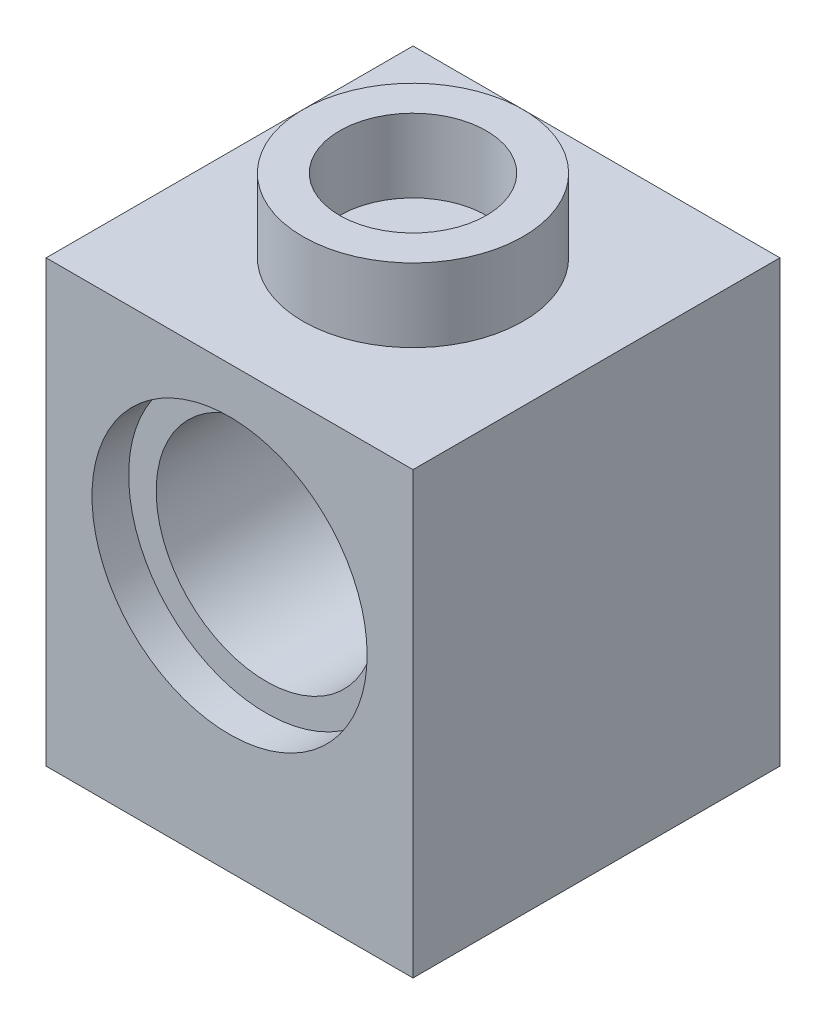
ISO-10303-21;
HEADER;
FILE_DESCRIPTION(('STEP AP214'),'2;1');
FILE_NAME('part.step','',(''),(''),'','','');
FILE_SCHEMA(('AUTOMOTIVE_DESIGN { 1 0 10303 214 1 1 1 1 }'));
ENDSEC;
DATA;
#1=APPLICATION_CONTEXT('core data for automotive mechanical design processes');
#2=APPLICATION_PROTOCOL_DEFINITION('international standard','automotive_design',2000,#1);
#3=PRODUCT_CONTEXT('',#1,'mechanical');
#4=PRODUCT('Part','Part','',(#3));
#5=PRODUCT_RELATED_PRODUCT_CATEGORY('part','',(#4));
#6=PRODUCT_DEFINITION_FORMATION('','',#4);
#7=PRODUCT_DEFINITION_CONTEXT('part definition',#1,'design');
#8=PRODUCT_DEFINITION('design','',#6,#7);
#9=PRODUCT_DEFINITION_SHAPE('','',#8);
#10=(LENGTH_UNIT() NAMED_UNIT(*) SI_UNIT(.MILLI.,.METRE.));
#11=(NAMED_UNIT(*) PLANE_ANGLE_UNIT() SI_UNIT($,.RADIAN.));
#12=(NAMED_UNIT(*) SI_UNIT($,.STERADIAN.) SOLID_ANGLE_UNIT());
#13=UNCERTAINTY_MEASURE_WITH_UNIT(LENGTH_MEASURE(1.E-05),#10,'distance_accuracy_value','');
#14=(GEOMETRIC_REPRESENTATION_CONTEXT(3) GLOBAL_UNCERTAINTY_ASSIGNED_CONTEXT((#13)) GLOBAL_UNIT_ASSIGNED_CONTEXT((#10,
#11,#12)) REPRESENTATION_CONTEXT('',''));
#15=CARTESIAN_POINT('',(0.,0.,0.));
#16=DIRECTION('',(0.,0.,1.));
#17=DIRECTION('',(1.,0.,0.));
#18=AXIS2_PLACEMENT_3D('',#15,#16,#17);
#19=CARTESIAN_POINT('',(4.,5.6,-11.8));
#20=DIRECTION('',(0.,0.,1.));
#21=DIRECTION('',(1.,0.,0.));
#22=AXIS2_PLACEMENT_3D('',#19,#20,#21);
#23=CYLINDRICAL_SURFACE('',#22,2.4);
#24=CARTESIAN_POINT('',(4.,5.6,-0.8));
#25=DIRECTION('',(0.,0.,1.));
#26=DIRECTION('',(1.,0.,0.));
#27=AXIS2_PLACEMENT_3D('',#24,#25,#26);
#28=CIRCLE('',#27,2.4);
#29=CARTESIAN_POINT('',(6.4,5.6,-0.8));
#30=VERTEX_POINT('',#29);
#31=EDGE_CURVE('E174',#30,#30,#28,.T.);
#32=ORIENTED_EDGE('',*,*,#31,.T.);
#33=EDGE_LOOP('',(#32));
#34=FACE_BOUND('',#33,.T.);
#35=CARTESIAN_POINT('',(4.,5.6,-7.2));
#36=DIRECTION('',(0.,0.,-1.));
#37=DIRECTION('',(-1.,0.,0.));
#38=AXIS2_PLACEMENT_3D('',#35,#36,#37);
#39=CIRCLE('',#38,2.4);
#40=CARTESIAN_POINT('',(1.6,5.6,-7.2));
#41=VERTEX_POINT('',#40);
#42=EDGE_CURVE('E164',#41,#41,#39,.F.);
#43=ORIENTED_EDGE('',*,*,#42,.F.);
#44=EDGE_LOOP('',(#43));
#45=FACE_BOUND('',#44,.T.);
#46=ADVANCED_FACE('F38',(#34,#45),#23,.F.);
#47=CARTESIAN_POINT('',(0.,9.6,0.));
#48=DIRECTION('',(1.,0.,0.));
#49=DIRECTION('',(0.,0.,-1.));
#50=AXIS2_PLACEMENT_3D('',#47,#48,#49);
#51=PLANE('',#50);
#52=DIRECTION('',(0.,0.,1.));
#53=VECTOR('',#52,1.);
#54=CARTESIAN_POINT('',(0.,0.,0.));
#55=LINE('',#54,#53);
#56=CARTESIAN_POINT('',(0.,0.,-8.));
#57=VERTEX_POINT('',#56);
#58=CARTESIAN_POINT('',(0.,0.,0.));
#59=VERTEX_POINT('',#58);
#60=EDGE_CURVE('E170',#57,#59,#55,.T.);
#61=ORIENTED_EDGE('',*,*,#60,.T.);
#62=DIRECTION('',(0.,-1.,0.));
#63=VECTOR('',#62,1.);
#64=CARTESIAN_POINT('',(0.,9.6,0.));
#65=LINE('',#64,#63);
#66=CARTESIAN_POINT('',(0.,9.6,0.));
#67=VERTEX_POINT('',#66);
#68=EDGE_CURVE('E46',#67,#59,#65,.T.);
#69=ORIENTED_EDGE('',*,*,#68,.F.);
#70=DIRECTION('',(0.,0.,1.));
#71=VECTOR('',#70,1.);
#72=CARTESIAN_POINT('',(0.,9.6,0.));
#73=LINE('',#72,#71);
#74=CARTESIAN_POINT('',(0.,9.6,-8.));
#75=VERTEX_POINT('',#74);
#76=EDGE_CURVE('E175',#75,#67,#73,.T.);
#77=ORIENTED_EDGE('',*,*,#76,.F.);
#78=DIRECTION('',(0.,-1.,0.));
#79=VECTOR('',#78,1.);
#80=CARTESIAN_POINT('',(0.,9.6,-8.));
#81=LINE('',#80,#79);
#82=EDGE_CURVE('E181',#75,#57,#81,.T.);
#83=ORIENTED_EDGE('',*,*,#82,.T.);
#84=EDGE_LOOP('',(#61,#69,#77,#83));
#85=FACE_BOUND('',#84,.T.);
#86=ADVANCED_FACE('F40',(#85),#51,.F.);
#87=CARTESIAN_POINT('',(0.,9.6,0.));
#88=DIRECTION('',(0.,0.,-1.));
#89=DIRECTION('',(-1.,0.,0.));
#90=AXIS2_PLACEMENT_3D('',#87,#88,#89);
#91=PLANE('',#90);
#92=CARTESIAN_POINT('',(4.,5.6,0.));
#93=DIRECTION('',(0.,0.,1.));
#94=DIRECTION('',(1.,0.,0.));
#95=AXIS2_PLACEMENT_3D('',#92,#93,#94);
#96=CIRCLE('',#95,3.);
#97=CARTESIAN_POINT('',(7.,5.6,0.));
#98=VERTEX_POINT('',#97);
#99=EDGE_CURVE('E171',#98,#98,#96,.T.);
#100=ORIENTED_EDGE('',*,*,#99,.F.);
#101=EDGE_LOOP('',(#100));
#102=FACE_BOUND('',#101,.T.);
#103=DIRECTION('',(1.,0.,0.));
#104=VECTOR('',#103,1.);
#105=CARTESIAN_POINT('',(0.,0.,0.));
#106=LINE('',#105,#104);
#107=CARTESIAN_POINT('',(8.,0.,0.));
#108=VERTEX_POINT('',#107);
#109=EDGE_CURVE('E184',#59,#108,#106,.T.);
#110=ORIENTED_EDGE('',*,*,#109,.T.);
#111=DIRECTION('',(0.,-1.,0.));
#112=VECTOR('',#111,1.);
#113=CARTESIAN_POINT('',(8.,9.6,0.));
#114=LINE('',#113,#112);
#115=CARTESIAN_POINT('',(8.,9.6,0.));
#116=VERTEX_POINT('',#115);
#117=EDGE_CURVE('E192',#116,#108,#114,.T.);
#118=ORIENTED_EDGE('',*,*,#117,.F.);
#119=DIRECTION('',(1.,0.,0.));
#120=VECTOR('',#119,1.);
#121=CARTESIAN_POINT('',(0.,9.6,0.));
#122=LINE('',#121,#120);
#123=EDGE_CURVE('E91',#67,#116,#122,.T.);
#124=ORIENTED_EDGE('',*,*,#123,.F.);
#125=ORIENTED_EDGE('',*,*,#68,.T.);
#126=EDGE_LOOP('',(#110,#118,#124,#125));
#127=FACE_BOUND('',#126,.T.);
#128=ADVANCED_FACE('F208',(#102,#127),#91,.F.);
#129=CARTESIAN_POINT('',(8.,9.6,0.));
#130=DIRECTION('',(-1.,0.,0.));
#131=DIRECTION('',(0.,0.,1.));
#132=AXIS2_PLACEMENT_3D('',#129,#130,#131);
#133=PLANE('',#132);
#134=DIRECTION('',(0.,0.,-1.));
#135=VECTOR('',#134,1.);
#136=CARTESIAN_POINT('',(8.,0.,0.));
#137=LINE('',#136,#135);
#138=CARTESIAN_POINT('',(8.,0.,-8.));
#139=VERTEX_POINT('',#138);
#140=EDGE_CURVE('E186',#108,#139,#137,.T.);
#141=ORIENTED_EDGE('',*,*,#140,.T.);
#142=DIRECTION('',(0.,-1.,0.));
#143=VECTOR('',#142,1.);
#144=CARTESIAN_POINT('',(8.,9.6,-8.));
#145=LINE('',#144,#143);
#146=CARTESIAN_POINT('',(8.,9.6,-8.));
#147=VERTEX_POINT('',#146);
#148=EDGE_CURVE('E190',#147,#139,#145,.T.);
#149=ORIENTED_EDGE('',*,*,#148,.F.);
#150=DIRECTION('',(0.,0.,-1.));
#151=VECTOR('',#150,1.);
#152=CARTESIAN_POINT('',(8.,9.6,0.));
#153=LINE('',#152,#151);
#154=EDGE_CURVE('E178',#116,#147,#153,.T.);
#155=ORIENTED_EDGE('',*,*,#154,.F.);
#156=ORIENTED_EDGE('',*,*,#117,.T.);
#157=EDGE_LOOP('',(#141,#149,#155,#156));
#158=FACE_BOUND('',#157,.T.);
#159=ADVANCED_FACE('F234',(#158),#133,.F.);
#160=CARTESIAN_POINT('',(8.,9.6,-8.));
#161=DIRECTION('',(0.,0.,1.));
#162=DIRECTION('',(1.,0.,0.));
#163=AXIS2_PLACEMENT_3D('',#160,#161,#162);
#164=PLANE('',#163);
#165=CARTESIAN_POINT('',(4.,5.6,-8.));
#166=DIRECTION('',(0.,0.,1.));
#167=DIRECTION('',(1.,0.,0.));
#168=AXIS2_PLACEMENT_3D('',#165,#166,#167);
#169=CIRCLE('',#168,3.);
#170=CARTESIAN_POINT('',(7.,5.6,-8.));
#171=VERTEX_POINT('',#170);
#172=EDGE_CURVE('E158',#171,#171,#169,.T.);
#173=ORIENTED_EDGE('',*,*,#172,.T.);
#174=EDGE_LOOP('',(#173));
#175=FACE_BOUND('',#174,.T.);
#176=DIRECTION('',(-1.,0.,0.));
#177=VECTOR('',#176,1.);
#178=CARTESIAN_POINT('',(8.,0.,-8.));
#179=LINE('',#178,#177);
#180=EDGE_CURVE('E83',#139,#57,#179,.T.);
#181=ORIENTED_EDGE('',*,*,#180,.T.);
#182=ORIENTED_EDGE('',*,*,#82,.F.);
#183=DIRECTION('',(-1.,0.,0.));
#184=VECTOR('',#183,1.);
#185=CARTESIAN_POINT('',(8.,9.6,-8.));
#186=LINE('',#185,#184);
#187=EDGE_CURVE('E62',#147,#75,#186,.T.);
#188=ORIENTED_EDGE('',*,*,#187,.F.);
#189=ORIENTED_EDGE('',*,*,#148,.T.);
#190=EDGE_LOOP('',(#181,#182,#188,#189));
#191=FACE_BOUND('',#190,.T.);
#192=ADVANCED_FACE('F226',(#175,#191),#164,.F.);
#193=CARTESIAN_POINT('',(0.,9.6,0.));
#194=DIRECTION('',(0.,1.,0.));
#195=DIRECTION('',(0.,0.,1.));
#196=AXIS2_PLACEMENT_3D('',#193,#194,#195);
#197=PLANE('',#196);
#198=CARTESIAN_POINT('',(4.,9.6,-4.));
#199=DIRECTION('',(0.,1.,0.));
#200=DIRECTION('',(0.,0.,1.));
#201=AXIS2_PLACEMENT_3D('',#198,#199,#200);
#202=CIRCLE('',#201,2.4);
#203=CARTESIAN_POINT('',(4.,9.6,-1.6));
#204=VERTEX_POINT('',#203);
#205=EDGE_CURVE('E154',#204,#204,#202,.T.);
#206=ORIENTED_EDGE('',*,*,#205,.F.);
#207=EDGE_LOOP('',(#206));
#208=FACE_BOUND('',#207,.T.);
#209=ORIENTED_EDGE('',*,*,#76,.T.);
#210=ORIENTED_EDGE('',*,*,#123,.T.);
#211=ORIENTED_EDGE('',*,*,#154,.T.);
#212=ORIENTED_EDGE('',*,*,#187,.T.);
#213=EDGE_LOOP('',(#209,#210,#211,#212));
#214=FACE_BOUND('',#213,.T.);
#215=ADVANCED_FACE('F223',(#208,#214),#197,.T.);
#216=CARTESIAN_POINT('',(0.,0.,0.));
#217=DIRECTION('',(0.,1.,0.));
#218=DIRECTION('',(0.,0.,1.));
#219=AXIS2_PLACEMENT_3D('',#216,#217,#218);
#220=PLANE('',#219);
#221=DIRECTION('',(1.,0.,0.));
#222=VECTOR('',#221,1.);
#223=CARTESIAN_POINT('',(1.6,0.,-6.4));
#224=LINE('',#223,#222);
#225=CARTESIAN_POINT('',(1.6,0.,-6.4));
#226=VERTEX_POINT('',#225);
#227=CARTESIAN_POINT('',(6.4,0.,-6.4));
#228=VERTEX_POINT('',#227);
#229=EDGE_CURVE('E142',#226,#228,#224,.T.);
#230=ORIENTED_EDGE('',*,*,#229,.F.);
#231=DIRECTION('',(0.,0.,-1.));
#232=VECTOR('',#231,1.);
#233=CARTESIAN_POINT('',(1.6,0.,-6.4));
#234=LINE('',#233,#232);
#235=CARTESIAN_POINT('',(1.6,0.,-1.6));
#236=VERTEX_POINT('',#235);
#237=EDGE_CURVE('E53',#236,#226,#234,.T.);
#238=ORIENTED_EDGE('',*,*,#237,.F.);
#239=DIRECTION('',(-1.,0.,0.));
#240=VECTOR('',#239,1.);
#241=CARTESIAN_POINT('',(1.6,0.,-1.6));
#242=LINE('',#241,#240);
#243=CARTESIAN_POINT('',(6.4,0.,-1.6));
#244=VERTEX_POINT('',#243);
#245=EDGE_CURVE('E133',#244,#236,#242,.T.);
#246=ORIENTED_EDGE('',*,*,#245,.F.);
#247=DIRECTION('',(0.,0.,1.));
#248=VECTOR('',#247,1.);
#249=CARTESIAN_POINT('',(6.4,0.,-6.4));
#250=LINE('',#249,#248);
#251=EDGE_CURVE('E136',#228,#244,#250,.T.);
#252=ORIENTED_EDGE('',*,*,#251,.F.);
#253=EDGE_LOOP('',(#230,#238,#246,#252));
#254=FACE_BOUND('',#253,.T.);
#255=ORIENTED_EDGE('',*,*,#60,.F.);
#256=ORIENTED_EDGE('',*,*,#180,.F.);
#257=ORIENTED_EDGE('',*,*,#140,.F.);
#258=ORIENTED_EDGE('',*,*,#109,.F.);
#259=EDGE_LOOP('',(#255,#256,#257,#258));
#260=FACE_BOUND('',#259,.T.);
#261=ADVANCED_FACE('F221',(#254,#260),#220,.F.);
#262=CARTESIAN_POINT('',(4.,5.6,-0.8));
#263=DIRECTION('',(0.,0.,1.));
#264=DIRECTION('',(1.,0.,0.));
#265=AXIS2_PLACEMENT_3D('',#262,#263,#264);
#266=CYLINDRICAL_SURFACE('',#265,3.);
#267=CARTESIAN_POINT('',(4.,5.6,-0.8));
#268=DIRECTION('',(0.,0.,1.));
#269=DIRECTION('',(1.,0.,0.));
#270=AXIS2_PLACEMENT_3D('',#267,#268,#269);
#271=CIRCLE('',#270,3.);
#272=CARTESIAN_POINT('',(7.,5.6,-0.8));
#273=VERTEX_POINT('',#272);
#274=EDGE_CURVE('E167',#273,#273,#271,.T.);
#275=ORIENTED_EDGE('',*,*,#274,.F.);
#276=EDGE_LOOP('',(#275));
#277=FACE_BOUND('',#276,.T.);
#278=ORIENTED_EDGE('',*,*,#99,.T.);
#279=EDGE_LOOP('',(#278));
#280=FACE_BOUND('',#279,.T.);
#281=ADVANCED_FACE('F217',(#277,#280),#266,.F.);
#282=CARTESIAN_POINT('',(4.,5.6,-0.8));
#283=DIRECTION('',(0.,0.,1.));
#284=DIRECTION('',(1.,0.,0.));
#285=AXIS2_PLACEMENT_3D('',#282,#283,#284);
#286=PLANE('',#285);
#287=ORIENTED_EDGE('',*,*,#31,.F.);
#288=EDGE_LOOP('',(#287));
#289=FACE_BOUND('',#288,.T.);
#290=ORIENTED_EDGE('',*,*,#274,.T.);
#291=EDGE_LOOP('',(#290));
#292=FACE_BOUND('',#291,.T.);
#293=ADVANCED_FACE('F214',(#289,#292),#286,.T.);
#294=CARTESIAN_POINT('',(4.,5.6,-7.2));
#295=DIRECTION('',(0.,0.,-1.));
#296=DIRECTION('',(1.,0.,0.));
#297=AXIS2_PLACEMENT_3D('',#294,#295,#296);
#298=PLANE('',#297);
#299=CARTESIAN_POINT('',(4.,5.6,-7.2));
#300=DIRECTION('',(0.,0.,1.));
#301=DIRECTION('',(1.,0.,0.));
#302=AXIS2_PLACEMENT_3D('',#299,#300,#301);
#303=CIRCLE('',#302,3.);
#304=CARTESIAN_POINT('',(7.,5.6,-7.2));
#305=VERTEX_POINT('',#304);
#306=EDGE_CURVE('E161',#305,#305,#303,.T.);
#307=ORIENTED_EDGE('',*,*,#306,.F.);
#308=EDGE_LOOP('',(#307));
#309=FACE_BOUND('',#308,.T.);
#310=ORIENTED_EDGE('',*,*,#42,.T.);
#311=EDGE_LOOP('',(#310));
#312=FACE_BOUND('',#311,.T.);
#313=ADVANCED_FACE('F200',(#309,#312),#298,.T.);
#314=CARTESIAN_POINT('',(4.,5.6,-7.2));
#315=DIRECTION('',(0.,0.,-1.));
#316=DIRECTION('',(-1.,0.,0.));
#317=AXIS2_PLACEMENT_3D('',#314,#315,#316);
#318=CYLINDRICAL_SURFACE('',#317,3.);
#319=ORIENTED_EDGE('',*,*,#306,.T.);
#320=EDGE_LOOP('',(#319));
#321=FACE_BOUND('',#320,.T.);
#322=ORIENTED_EDGE('',*,*,#172,.F.);
#323=EDGE_LOOP('',(#322));
#324=FACE_BOUND('',#323,.T.);
#325=ADVANCED_FACE('F212',(#321,#324),#318,.F.);
#326=CARTESIAN_POINT('',(4.,11.2,-4.));
#327=DIRECTION('',(0.,1.,0.));
#328=DIRECTION('',(0.,0.,1.));
#329=AXIS2_PLACEMENT_3D('',#326,#327,#328);
#330=PLANE('',#329);
#331=CARTESIAN_POINT('',(4.,11.2,-4.));
#332=DIRECTION('',(0.,1.,0.));
#333=DIRECTION('',(0.,0.,1.));
#334=AXIS2_PLACEMENT_3D('',#331,#332,#333);
#335=CIRCLE('',#334,2.4);
#336=CARTESIAN_POINT('',(4.,11.2,-1.6));
#337=VERTEX_POINT('',#336);
#338=EDGE_CURVE('E155',#337,#337,#335,.T.);
#339=ORIENTED_EDGE('',*,*,#338,.T.);
#340=EDGE_LOOP('',(#339));
#341=FACE_BOUND('',#340,.T.);
#342=CARTESIAN_POINT('',(4.,11.2,-4.));
#343=DIRECTION('',(0.,1.,0.));
#344=DIRECTION('',(0.,0.,1.));
#345=AXIS2_PLACEMENT_3D('',#342,#343,#344);
#346=CIRCLE('',#345,1.6);
#347=CARTESIAN_POINT('',(4.,11.2,-2.4));
#348=VERTEX_POINT('',#347);
#349=EDGE_CURVE('E148',#348,#348,#346,.T.);
#350=ORIENTED_EDGE('',*,*,#349,.F.);
#351=EDGE_LOOP('',(#350));
#352=FACE_BOUND('',#351,.T.);
#353=ADVANCED_FACE('F292',(#341,#352),#330,.T.);
#354=CARTESIAN_POINT('',(4.,11.2,-4.));
#355=DIRECTION('',(0.,-1.,0.));
#356=DIRECTION('',(0.,0.,-1.));
#357=AXIS2_PLACEMENT_3D('',#354,#355,#356);
#358=CYLINDRICAL_SURFACE('',#357,2.4);
#359=ORIENTED_EDGE('',*,*,#338,.F.);
#360=EDGE_LOOP('',(#359));
#361=FACE_BOUND('',#360,.T.);
#362=ORIENTED_EDGE('',*,*,#205,.T.);
#363=EDGE_LOOP('',(#362));
#364=FACE_BOUND('',#363,.T.);
#365=ADVANCED_FACE('F299',(#361,#364),#358,.T.);
#366=CARTESIAN_POINT('',(4.,11.2,-4.));
#367=DIRECTION('',(0.,-1.,0.));
#368=DIRECTION('',(0.,0.,-1.));
#369=AXIS2_PLACEMENT_3D('',#366,#367,#368);
#370=CYLINDRICAL_SURFACE('',#369,1.6);
#371=ORIENTED_EDGE('',*,*,#349,.T.);
#372=EDGE_LOOP('',(#371));
#373=FACE_BOUND('',#372,.T.);
#374=CARTESIAN_POINT('',(4.,9.6,-4.));
#375=DIRECTION('',(0.,1.,0.));
#376=DIRECTION('',(0.,0.,1.));
#377=AXIS2_PLACEMENT_3D('',#374,#375,#376);
#378=CIRCLE('',#377,1.6);
#379=CARTESIAN_POINT('',(4.,9.6,-2.4));
#380=VERTEX_POINT('',#379);
#381=EDGE_CURVE('E11',#380,#380,#378,.F.);
#382=ORIENTED_EDGE('',*,*,#381,.T.);
#383=EDGE_LOOP('',(#382));
#384=FACE_BOUND('',#383,.T.);
#385=ADVANCED_FACE('F307',(#373,#384),#370,.F.);
#386=ORIENTED_EDGE('',*,*,#381,.F.);
#387=EDGE_LOOP('',(#386));
#388=FACE_BOUND('',#387,.T.);
#389=ADVANCED_FACE('F228',(#388),#197,.T.);
#390=CARTESIAN_POINT('',(1.6,1.6,-6.4));
#391=DIRECTION('',(-1.,0.,0.));
#392=DIRECTION('',(0.,0.,1.));
#393=AXIS2_PLACEMENT_3D('',#390,#391,#392);
#394=PLANE('',#393);
#395=ORIENTED_EDGE('',*,*,#237,.T.);
#396=DIRECTION('',(0.,-1.,0.));
#397=VECTOR('',#396,1.);
#398=CARTESIAN_POINT('',(1.6,1.6,-6.4));
#399=LINE('',#398,#397);
#400=CARTESIAN_POINT('',(1.6,1.6,-6.4));
#401=VERTEX_POINT('',#400);
#402=EDGE_CURVE('E111',#401,#226,#399,.T.);
#403=ORIENTED_EDGE('',*,*,#402,.F.);
#404=DIRECTION('',(0.,0.,-1.));
#405=VECTOR('',#404,1.);
#406=CARTESIAN_POINT('',(1.6,1.6,-6.4));
#407=LINE('',#406,#405);
#408=CARTESIAN_POINT('',(1.6,1.6,-1.6));
#409=VERTEX_POINT('',#408);
#410=EDGE_CURVE('E115',#409,#401,#407,.T.);
#411=ORIENTED_EDGE('',*,*,#410,.F.);
#412=DIRECTION('',(0.,-1.,0.));
#413=VECTOR('',#412,1.);
#414=CARTESIAN_POINT('',(1.6,1.6,-1.6));
#415=LINE('',#414,#413);
#416=EDGE_CURVE('E146',#409,#236,#415,.T.);
#417=ORIENTED_EDGE('',*,*,#416,.T.);
#418=EDGE_LOOP('',(#395,#403,#411,#417));
#419=FACE_BOUND('',#418,.T.);
#420=ADVANCED_FACE('F113',(#419),#394,.F.);
#421=CARTESIAN_POINT('',(1.6,1.6,-1.6));
#422=DIRECTION('',(0.,0.,1.));
#423=DIRECTION('',(1.,0.,0.));
#424=AXIS2_PLACEMENT_3D('',#421,#422,#423);
#425=PLANE('',#424);
#426=ORIENTED_EDGE('',*,*,#245,.T.);
#427=ORIENTED_EDGE('',*,*,#416,.F.);
#428=DIRECTION('',(-1.,0.,0.));
#429=VECTOR('',#428,1.);
#430=CARTESIAN_POINT('',(1.6,1.6,-1.6));
#431=LINE('',#430,#429);
#432=CARTESIAN_POINT('',(6.4,1.6,-1.6));
#433=VERTEX_POINT('',#432);
#434=EDGE_CURVE('E121',#433,#409,#431,.T.);
#435=ORIENTED_EDGE('',*,*,#434,.F.);
#436=DIRECTION('',(0.,-1.,0.));
#437=VECTOR('',#436,1.);
#438=CARTESIAN_POINT('',(6.4,1.6,-1.6));
#439=LINE('',#438,#437);
#440=EDGE_CURVE('E149',#433,#244,#439,.T.);
#441=ORIENTED_EDGE('',*,*,#440,.T.);
#442=EDGE_LOOP('',(#426,#427,#435,#441));
#443=FACE_BOUND('',#442,.T.);
#444=ADVANCED_FACE('F326',(#443),#425,.F.);
#445=CARTESIAN_POINT('',(6.4,1.6,-6.4));
#446=DIRECTION('',(1.,0.,0.));
#447=DIRECTION('',(0.,0.,-1.));
#448=AXIS2_PLACEMENT_3D('',#445,#446,#447);
#449=PLANE('',#448);
#450=ORIENTED_EDGE('',*,*,#251,.T.);
#451=ORIENTED_EDGE('',*,*,#440,.F.);
#452=DIRECTION('',(0.,0.,1.));
#453=VECTOR('',#452,1.);
#454=CARTESIAN_POINT('',(6.4,1.6,-6.4));
#455=LINE('',#454,#453);
#456=CARTESIAN_POINT('',(6.4,1.6,-6.4));
#457=VERTEX_POINT('',#456);
#458=EDGE_CURVE('E129',#457,#433,#455,.T.);
#459=ORIENTED_EDGE('',*,*,#458,.F.);
#460=DIRECTION('',(0.,-1.,0.));
#461=VECTOR('',#460,1.);
#462=CARTESIAN_POINT('',(6.4,1.6,-6.4));
#463=LINE('',#462,#461);
#464=EDGE_CURVE('E120',#457,#228,#463,.T.);
#465=ORIENTED_EDGE('',*,*,#464,.T.);
#466=EDGE_LOOP('',(#450,#451,#459,#465));
#467=FACE_BOUND('',#466,.T.);
#468=ADVANCED_FACE('F333',(#467),#449,.F.);
#469=CARTESIAN_POINT('',(1.6,1.6,-6.4));
#470=DIRECTION('',(0.,0.,-1.));
#471=DIRECTION('',(-1.,0.,0.));
#472=AXIS2_PLACEMENT_3D('',#469,#470,#471);
#473=PLANE('',#472);
#474=ORIENTED_EDGE('',*,*,#229,.T.);
#475=ORIENTED_EDGE('',*,*,#464,.F.);
#476=DIRECTION('',(1.,0.,0.));
#477=VECTOR('',#476,1.);
#478=CARTESIAN_POINT('',(1.6,1.6,-6.4));
#479=LINE('',#478,#477);
#480=EDGE_CURVE('E124',#401,#457,#479,.T.);
#481=ORIENTED_EDGE('',*,*,#480,.F.);
#482=ORIENTED_EDGE('',*,*,#402,.T.);
#483=EDGE_LOOP('',(#474,#475,#481,#482));
#484=FACE_BOUND('',#483,.T.);
#485=ADVANCED_FACE('F125',(#484),#473,.F.);
#486=CARTESIAN_POINT('',(0.,1.6,0.));
#487=DIRECTION('',(0.,1.,0.));
#488=DIRECTION('',(0.,0.,1.));
#489=AXIS2_PLACEMENT_3D('',#486,#487,#488);
#490=PLANE('',#489);
#491=ORIENTED_EDGE('',*,*,#410,.T.);
#492=ORIENTED_EDGE('',*,*,#480,.T.);
#493=ORIENTED_EDGE('',*,*,#458,.T.);
#494=ORIENTED_EDGE('',*,*,#434,.T.);
#495=EDGE_LOOP('',(#491,#492,#493,#494));
#496=FACE_BOUND('',#495,.T.);
#497=ADVANCED_FACE('F131',(#496),#490,.F.);
#498=CLOSED_SHELL('',(#46,#86,#128,#159,#192,#215,#261,#281,#293,#313,#325,#353,#365,#385,#389,
#420,#444,#468,#485,#497));
#499=MANIFOLD_SOLID_BREP('B2',#498);
#500=ADVANCED_BREP_SHAPE_REPRESENTATION('',(#18,#499),#14);
#501=SHAPE_DEFINITION_REPRESENTATION(#9,#500);
ENDSEC;
END-ISO-10303-21;
